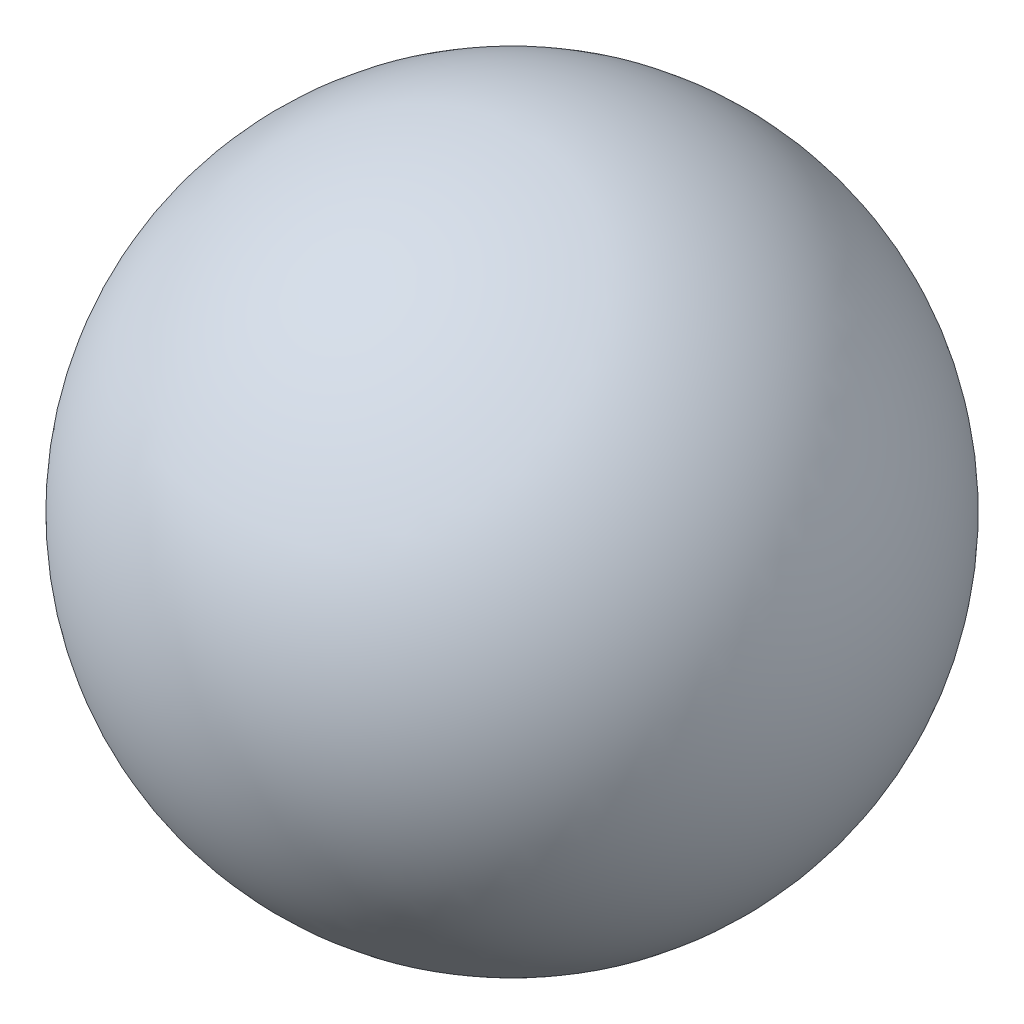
from build123d import *


with BuildPart() as part:
    # Sketch1 → Revolve1 (revolve)
    with BuildSketch(Plane.XY):
        with BuildLine():
            Line((0, 1.190625), (0, -1.190625))
            ThreePointArc((0, -1.190625), (1.190625, 0), (0, 1.190625))
        make_face()
    revolve(axis=Axis((0, 1.190625, 0), (0, -1, 0)))


solid = part.part
